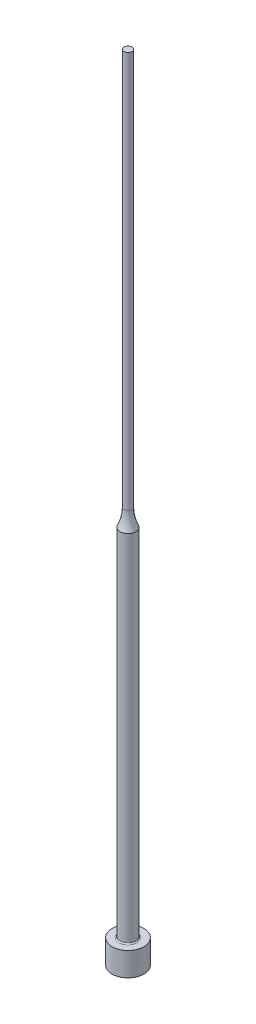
from build123d import *


with BuildPart() as part:
    # Sketch1 → Revolve1 (revolve)
    with BuildSketch(Plane.XY, mode=Mode.PRIVATE) as revolve1_sk:
        with BuildLine():
            Line((0, 0), (4, 0))
            Line((4, 0), (4, 6))
            Line((4, 6), (2.3, 6))
            ThreePointArc((2.3, 6), (2.087867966, 6.087867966), (2, 6.3))
            Line((2, 6.3), (2, 95.641101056))
            ThreePointArc((2, 95.641101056), (1.253205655, 97.763932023), (1, 100))
            Line((1, 100), (1, 200))
            Line((1, 200), (0, 200))
            Line((0, 200), (0, 0))
        make_face()
    revolve(revolve1_sk.sketch.rotate(Axis((0, 200, 0), (0, -1, 0)), 180), axis=Axis((0, 200, 0), (0, -1, 0)))


solid = part.part
